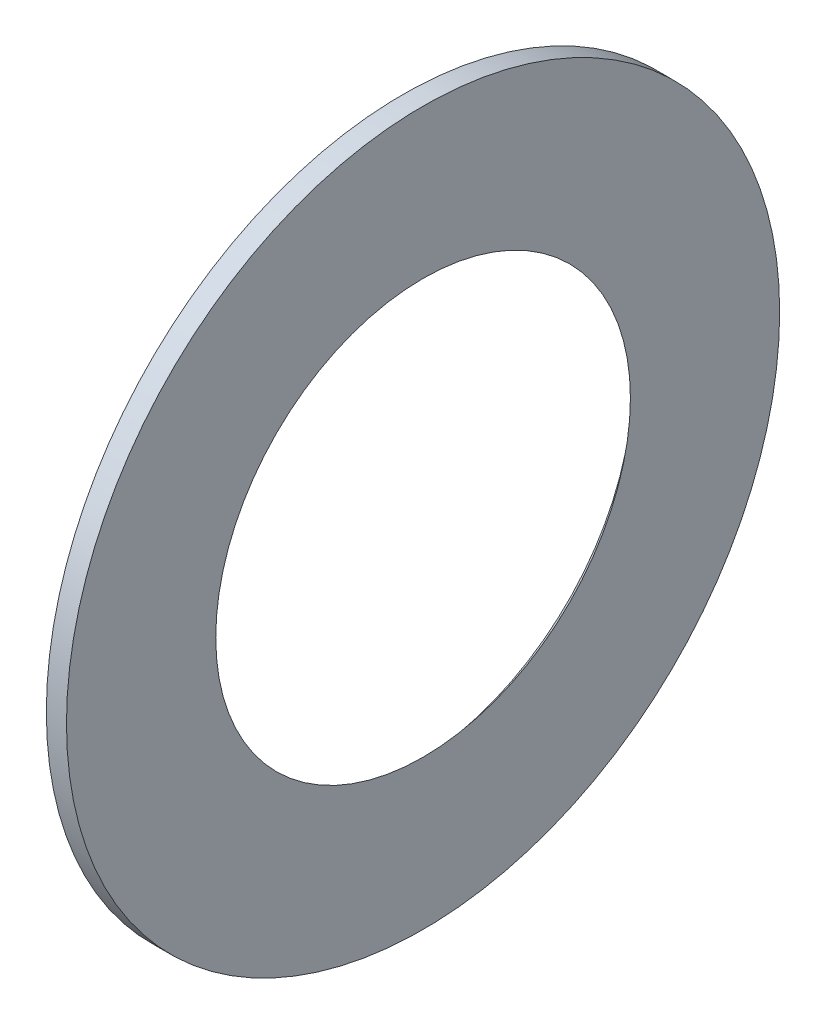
ISO-10303-21;
HEADER;
FILE_DESCRIPTION(('STEP AP214'),'2;1');
FILE_NAME('part.step','',(''),(''),'','','');
FILE_SCHEMA(('AUTOMOTIVE_DESIGN { 1 0 10303 214 1 1 1 1 }'));
ENDSEC;
DATA;
#1=APPLICATION_CONTEXT('core data for automotive mechanical design processes');
#2=APPLICATION_PROTOCOL_DEFINITION('international standard','automotive_design',2000,#1);
#3=PRODUCT_CONTEXT('',#1,'mechanical');
#4=PRODUCT('Part','Part','',(#3));
#5=PRODUCT_RELATED_PRODUCT_CATEGORY('part','',(#4));
#6=PRODUCT_DEFINITION_FORMATION('','',#4);
#7=PRODUCT_DEFINITION_CONTEXT('part definition',#1,'design');
#8=PRODUCT_DEFINITION('design','',#6,#7);
#9=PRODUCT_DEFINITION_SHAPE('','',#8);
#10=(LENGTH_UNIT() NAMED_UNIT(*) SI_UNIT(.MILLI.,.METRE.));
#11=(NAMED_UNIT(*) PLANE_ANGLE_UNIT() SI_UNIT($,.RADIAN.));
#12=(NAMED_UNIT(*) SI_UNIT($,.STERADIAN.) SOLID_ANGLE_UNIT());
#13=UNCERTAINTY_MEASURE_WITH_UNIT(LENGTH_MEASURE(1.E-05),#10,'distance_accuracy_value','');
#14=(GEOMETRIC_REPRESENTATION_CONTEXT(3) GLOBAL_UNCERTAINTY_ASSIGNED_CONTEXT((#13)) GLOBAL_UNIT_ASSIGNED_CONTEXT((#10,
#11,#12)) REPRESENTATION_CONTEXT('',''));
#15=CARTESIAN_POINT('',(0.,0.,0.));
#16=DIRECTION('',(0.,0.,1.));
#17=DIRECTION('',(1.,0.,0.));
#18=AXIS2_PLACEMENT_3D('',#15,#16,#17);
#19=CARTESIAN_POINT('',(8.21999999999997,0.,0.));
#20=DIRECTION('',(-1.,0.,0.));
#21=DIRECTION('',(0.,0.,1.));
#22=AXIS2_PLACEMENT_3D('',#19,#20,#21);
#23=CONICAL_SURFACE('',#22,13.2078460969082,0.523598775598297);
#24=CARTESIAN_POINT('',(8.21999999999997,0.,0.));
#25=DIRECTION('',(-1.,0.,0.));
#26=DIRECTION('',(0.,0.,1.));
#27=AXIS2_PLACEMENT_3D('',#24,#25,#26);
#28=CIRCLE('',#27,13.2078460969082);
#29=CARTESIAN_POINT('',(8.21999999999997,0.,13.2078460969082));
#30=VERTEX_POINT('',#29);
#31=EDGE_CURVE('E17',#30,#30,#28,.F.);
#32=ORIENTED_EDGE('',*,*,#31,.F.);
#33=EDGE_LOOP('',(#32));
#34=FACE_BOUND('',#33,.T.);
#35=CARTESIAN_POINT('',(8.57999999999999,0.,0.));
#36=DIRECTION('',(-1.,0.,0.));
#37=DIRECTION('',(0.,0.,1.));
#38=AXIS2_PLACEMENT_3D('',#35,#36,#37);
#39=CIRCLE('',#38,13.);
#40=CARTESIAN_POINT('',(8.57999999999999,0.,13.));
#41=VERTEX_POINT('',#40);
#42=EDGE_CURVE('E33',#41,#41,#39,.T.);
#43=ORIENTED_EDGE('',*,*,#42,.F.);
#44=EDGE_LOOP('',(#43));
#45=FACE_BOUND('',#44,.T.);
#46=ADVANCED_FACE('F14',(#34,#45),#23,.F.);
#47=CARTESIAN_POINT('',(8.22,13.5078460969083,0.));
#48=DIRECTION('',(-1.,0.,0.));
#49=DIRECTION('',(0.,0.,1.));
#50=AXIS2_PLACEMENT_3D('',#47,#48,#49);
#51=PLANE('',#50);
#52=ORIENTED_EDGE('',*,*,#31,.T.);
#53=EDGE_LOOP('',(#52));
#54=FACE_BOUND('',#53,.T.);
#55=CARTESIAN_POINT('',(8.22,0.,0.));
#56=DIRECTION('',(-1.,0.,0.));
#57=DIRECTION('',(0.,0.,1.));
#58=AXIS2_PLACEMENT_3D('',#55,#56,#57);
#59=CIRCLE('',#58,13.8078460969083);
#60=CARTESIAN_POINT('',(8.22,0.,13.8078460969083));
#61=VERTEX_POINT('',#60);
#62=EDGE_CURVE('E31',#61,#61,#59,.F.);
#63=ORIENTED_EDGE('',*,*,#62,.F.);
#64=EDGE_LOOP('',(#63));
#65=FACE_BOUND('',#64,.T.);
#66=ADVANCED_FACE('F40',(#54,#65),#51,.T.);
#67=CARTESIAN_POINT('',(8.58,10.7641913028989,0.));
#68=DIRECTION('',(-1.,0.,0.));
#69=DIRECTION('',(0.,0.,1.));
#70=AXIS2_PLACEMENT_3D('',#67,#68,#69);
#71=PLANE('',#70);
#72=CARTESIAN_POINT('',(8.58,0.,0.));
#73=DIRECTION('',(-1.,0.,0.));
#74=DIRECTION('',(0.,0.,1.));
#75=AXIS2_PLACEMENT_3D('',#72,#73,#74);
#76=CIRCLE('',#75,8.52838260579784);
#77=CARTESIAN_POINT('',(8.58,0.,8.52838260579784));
#78=VERTEX_POINT('',#77);
#79=EDGE_CURVE('E26',#78,#78,#76,.F.);
#80=ORIENTED_EDGE('',*,*,#79,.T.);
#81=EDGE_LOOP('',(#80));
#82=FACE_BOUND('',#81,.T.);
#83=ORIENTED_EDGE('',*,*,#42,.T.);
#84=EDGE_LOOP('',(#83));
#85=FACE_BOUND('',#84,.T.);
#86=ADVANCED_FACE('F49',(#82,#85),#71,.T.);
#87=CARTESIAN_POINT('',(8.61,0.,0.));
#88=DIRECTION('',(-1.,0.,0.));
#89=DIRECTION('',(0.,0.,1.));
#90=AXIS2_PLACEMENT_3D('',#87,#88,#89);
#91=CYLINDRICAL_SURFACE('',#90,13.8078460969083);
#92=CARTESIAN_POINT('',(9.,0.,0.));
#93=DIRECTION('',(-1.,0.,0.));
#94=DIRECTION('',(0.,0.,1.));
#95=AXIS2_PLACEMENT_3D('',#92,#93,#94);
#96=CIRCLE('',#95,13.8078460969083);
#97=CARTESIAN_POINT('',(9.,0.,13.8078460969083));
#98=VERTEX_POINT('',#97);
#99=EDGE_CURVE('E21',#98,#98,#96,.F.);
#100=ORIENTED_EDGE('',*,*,#99,.F.);
#101=EDGE_LOOP('',(#100));
#102=FACE_BOUND('',#101,.T.);
#103=ORIENTED_EDGE('',*,*,#62,.T.);
#104=EDGE_LOOP('',(#103));
#105=FACE_BOUND('',#104,.T.);
#106=ADVANCED_FACE('F57',(#102,#105),#91,.T.);
#107=CARTESIAN_POINT('',(8.58,0.,0.));
#108=DIRECTION('',(-1.,0.,0.));
#109=DIRECTION('',(0.,0.,1.));
#110=AXIS2_PLACEMENT_3D('',#107,#108,#109);
#111=CONICAL_SURFACE('',#110,8.52838260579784,0.872664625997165);
#112=ORIENTED_EDGE('',*,*,#79,.F.);
#113=EDGE_LOOP('',(#112));
#114=FACE_BOUND('',#113,.T.);
#115=CARTESIAN_POINT('',(9.,0.,0.));
#116=DIRECTION('',(-1.,0.,0.));
#117=DIRECTION('',(0.,0.,1.));
#118=AXIS2_PLACEMENT_3D('',#115,#116,#117);
#119=CIRCLE('',#118,8.02784609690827);
#120=CARTESIAN_POINT('',(9.,0.,8.02784609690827));
#121=VERTEX_POINT('',#120);
#122=EDGE_CURVE('E10',#121,#121,#119,.T.);
#123=ORIENTED_EDGE('',*,*,#122,.F.);
#124=EDGE_LOOP('',(#123));
#125=FACE_BOUND('',#124,.T.);
#126=ADVANCED_FACE('F52',(#114,#125),#111,.F.);
#127=CARTESIAN_POINT('',(9.,10.9178460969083,0.));
#128=DIRECTION('',(1.,0.,0.));
#129=DIRECTION('',(0.,0.,-1.));
#130=AXIS2_PLACEMENT_3D('',#127,#128,#129);
#131=PLANE('',#130);
#132=ORIENTED_EDGE('',*,*,#122,.T.);
#133=EDGE_LOOP('',(#132));
#134=FACE_BOUND('',#133,.T.);
#135=ORIENTED_EDGE('',*,*,#99,.T.);
#136=EDGE_LOOP('',(#135));
#137=FACE_BOUND('',#136,.T.);
#138=ADVANCED_FACE('F50',(#134,#137),#131,.T.);
#139=CLOSED_SHELL('',(#46,#66,#86,#106,#126,#138));
#140=MANIFOLD_SOLID_BREP('B1',#139);
#141=ADVANCED_BREP_SHAPE_REPRESENTATION('',(#18,#140),#14);
#142=SHAPE_DEFINITION_REPRESENTATION(#9,#141);
ENDSEC;
END-ISO-10303-21;
